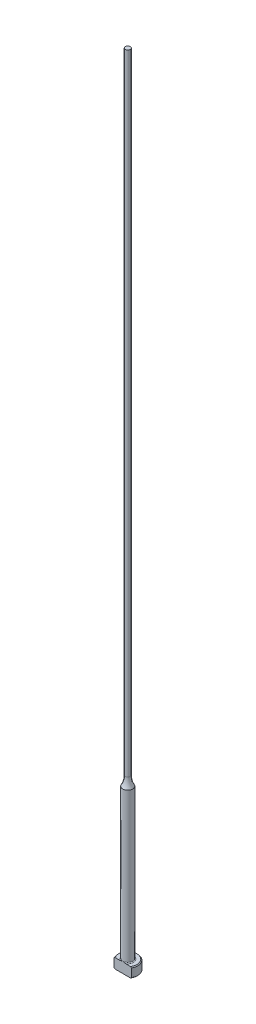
from build123d import *

# Parameters (mm, degrees)
CHAMFER1_SIZE      = 0.254
FILLET1_R          = 0.254
CUT_EXTRUDE1_DEPTH = 255.0396844


with BuildPart() as part:
    # Sketch1 → Revolve1 (revolve)
    with BuildSketch(Plane.XY, mode=Mode.PRIVATE) as revolve1_sk:
        with BuildLine():
            Line((0, 0), (-3.175, 0))
            Line((-3.175, 0), (-3.175, 3.175))
            Line((-3.175, 3.175), (-1.5875, 3.175))
            Line((-1.5875, 3.175), (-1.5875, 50.8))
            ThreePointArc((-1.5875, 50.8), (-0.995388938, 52.286680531), (-0.79375, 53.874180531))
            Line((-0.79375, 53.874180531), (-0.79375, 254))
            Line((-0.79375, 254), (0, 254))
            Line((0, 254), (0, 0))
        make_face()
    revolve(revolve1_sk.sketch.rotate(Axis((0, 259.958771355, 0), (0, -1, 0)), 270), axis=Axis((0, 259.958771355, 0), (0, -1, 0)))

    # Chamfer1
    chamfer1_edges = [part.edges().sort_by_distance(p)[0] for p in [
        (0, 0, -3.175),
        (0, 3.175, -3.175),
    ]]
    chamfer(chamfer1_edges, length=CHAMFER1_SIZE)

    # Fillet1
    fillet1_edges = [part.edges().sort_by_distance(p)[0] for p in [
        (0, 3.175, -1.5875),
    ]]
    fillet(fillet1_edges, radius=FILLET1_R)

    # Sketch2 → Cut-Extrude1 (cut, through all)
    with BuildSketch(Plane.XZ):
        with BuildLine():
            Line((-2.749630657, 1.5875), (2.749630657, 1.5875))
            ThreePointArc((2.749630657, 1.5875), (0, 3.175), (-2.749630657, 1.5875))
        make_face()
    extrude(amount=-CUT_EXTRUDE1_DEPTH, mode=Mode.SUBTRACT)


solid = part.part
